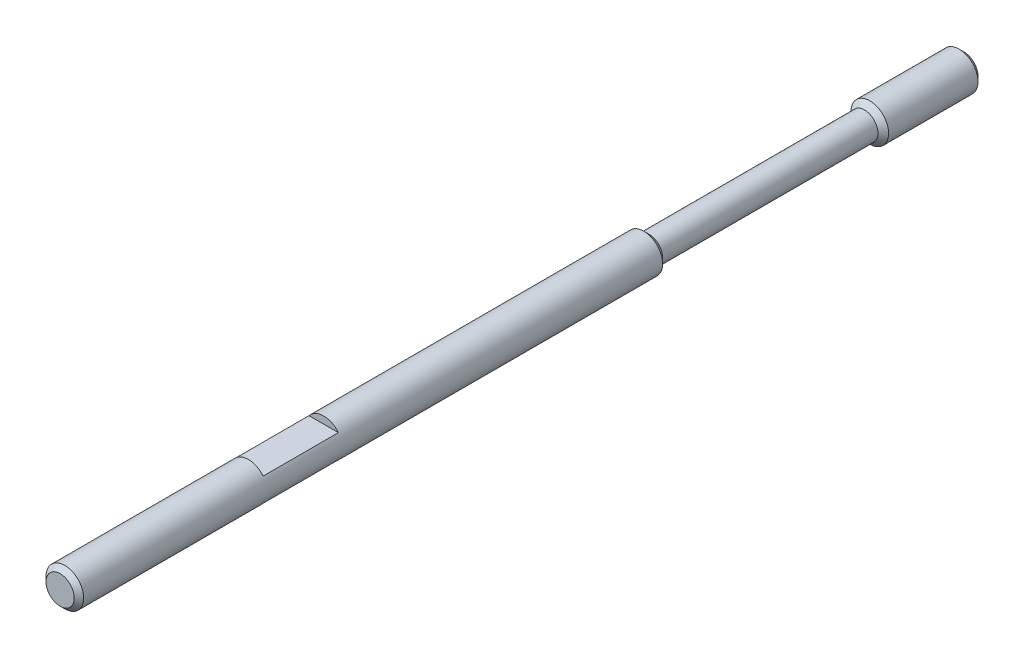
from build123d import *

# Parameters (mm, degrees)
SKETCH2_W          = 12.7
SKETCH2_H          = 5.047457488
CUT_EXTRUDE1_DEPTH = 7.9375
CHAMFER1_SIZE      = 0.79375


with BuildPart() as part:
    # Sketch1 → Revolve1 (revolve)
    with BuildSketch(Plane(origin=(0, 0, 0), x_dir=(0, 0, -1), z_dir=(1, 0, 0)), mode=Mode.PRIVATE) as revolve1_sk:
        Polygon((0, 0), (0, 3.175), (98.425, 3.175), (99.314, 2.286), (135.636, 2.286), (136.525, 3.175), (152.4, 3.175), (152.4, 0), align=None)
    revolve(revolve1_sk.sketch.rotate(Axis((0, 0, 0), (0, 0, 1)), 90), axis=Axis((0, 0, 0), (0, 0, 1)))

    # Sketch2 → Cut-Extrude1 (cut, symmetric)
    with BuildSketch(Plane(origin=(0, 0, 0), x_dir=(0, 0, -1), z_dir=(1, 0, 0))):
        with Locations((38.1, 4.508103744)):
            Rectangle(SKETCH2_W, SKETCH2_H)
        with Locations((38.1, -4.508103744)):
            Rectangle(SKETCH2_W, SKETCH2_H)
    extrude(amount=CUT_EXTRUDE1_DEPTH, both=True, mode=Mode.SUBTRACT)

    # Chamfer1
    chamfer1_edges = [part.edges().sort_by_distance(p)[0] for p in [
        (3.175, 0, -152.4),
        (3.175, 0, 0),
    ]]
    chamfer(chamfer1_edges, length=CHAMFER1_SIZE)


solid = part.part
